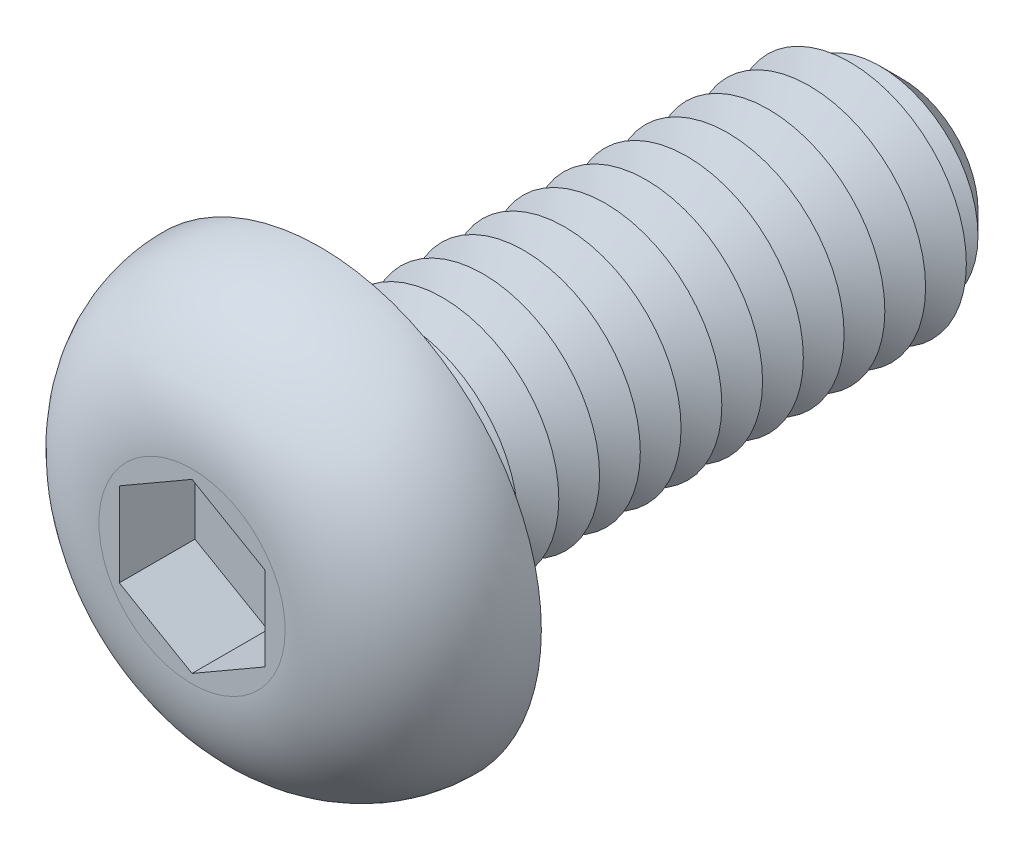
ISO-10303-21;
HEADER;
FILE_DESCRIPTION(('STEP AP214'),'2;1');
FILE_NAME('part.step','',(''),(''),'','','');
FILE_SCHEMA(('AUTOMOTIVE_DESIGN { 1 0 10303 214 1 1 1 1 }'));
ENDSEC;
DATA;
#1=APPLICATION_CONTEXT('core data for automotive mechanical design processes');
#2=APPLICATION_PROTOCOL_DEFINITION('international standard','automotive_design',2000,#1);
#3=PRODUCT_CONTEXT('',#1,'mechanical');
#4=PRODUCT('Part','Part','',(#3));
#5=PRODUCT_RELATED_PRODUCT_CATEGORY('part','',(#4));
#6=PRODUCT_DEFINITION_FORMATION('','',#4);
#7=PRODUCT_DEFINITION_CONTEXT('part definition',#1,'design');
#8=PRODUCT_DEFINITION('design','',#6,#7);
#9=PRODUCT_DEFINITION_SHAPE('','',#8);
#10=(LENGTH_UNIT() NAMED_UNIT(*) SI_UNIT(.MILLI.,.METRE.));
#11=(NAMED_UNIT(*) PLANE_ANGLE_UNIT() SI_UNIT($,.RADIAN.));
#12=(NAMED_UNIT(*) SI_UNIT($,.STERADIAN.) SOLID_ANGLE_UNIT());
#13=UNCERTAINTY_MEASURE_WITH_UNIT(LENGTH_MEASURE(1.E-05),#10,'distance_accuracy_value','');
#14=(GEOMETRIC_REPRESENTATION_CONTEXT(3) GLOBAL_UNCERTAINTY_ASSIGNED_CONTEXT((#13)) GLOBAL_UNIT_ASSIGNED_CONTEXT((#10,
#11,#12)) REPRESENTATION_CONTEXT('',''));
#15=CARTESIAN_POINT('',(0.,0.,0.));
#16=DIRECTION('',(0.,0.,1.));
#17=DIRECTION('',(1.,0.,0.));
#18=AXIS2_PLACEMENT_3D('',#15,#16,#17);
#19=CARTESIAN_POINT('',(0.,0.,-10.));
#20=DIRECTION('',(0.,0.,1.));
#21=DIRECTION('',(1.,0.,0.));
#22=AXIS2_PLACEMENT_3D('',#19,#20,#21);
#23=CYLINDRICAL_SURFACE('',#22,2.);
#24=CARTESIAN_POINT('',(0.,0.,-0.35));
#25=DIRECTION('',(0.,0.,1.));
#26=DIRECTION('',(1.,0.,0.));
#27=AXIS2_PLACEMENT_3D('',#24,#25,#26);
#28=CIRCLE('',#27,2.);
#29=CARTESIAN_POINT('',(2.,0.,-0.35));
#30=VERTEX_POINT('',#29);
#31=EDGE_CURVE('E48',#30,#30,#28,.F.);
#32=ORIENTED_EDGE('',*,*,#31,.T.);
#33=EDGE_LOOP('',(#32));
#34=FACE_BOUND('',#33,.T.);
#35=CARTESIAN_POINT('',(0.,0.,-0.699999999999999));
#36=DIRECTION('',(0.,0.,1.));
#37=DIRECTION('',(1.,0.,0.));
#38=AXIS2_PLACEMENT_3D('',#35,#36,#37);
#39=CIRCLE('',#38,2.);
#40=CARTESIAN_POINT('',(2.,0.,-0.699999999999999));
#41=VERTEX_POINT('',#40);
#42=EDGE_CURVE('E137',#41,#41,#39,.T.);
#43=ORIENTED_EDGE('',*,*,#42,.T.);
#44=EDGE_LOOP('',(#43));
#45=FACE_BOUND('',#44,.T.);
#46=ADVANCED_FACE('F39',(#34,#45),#23,.T.);
#47=CARTESIAN_POINT('',(0.,3.8,0.));
#48=DIRECTION('',(0.,0.,1.));
#49=DIRECTION('',(1.,0.,0.));
#50=AXIS2_PLACEMENT_3D('',#47,#48,#49);
#51=PLANE('',#50);
#52=CARTESIAN_POINT('',(0.,0.,0.));
#53=DIRECTION('',(0.,0.,1.));
#54=DIRECTION('',(1.,0.,0.));
#55=AXIS2_PLACEMENT_3D('',#52,#53,#54);
#56=CIRCLE('',#55,2.35);
#57=CARTESIAN_POINT('',(2.35,0.,0.));
#58=VERTEX_POINT('',#57);
#59=EDGE_CURVE('E11',#58,#58,#56,.T.);
#60=ORIENTED_EDGE('',*,*,#59,.T.);
#61=EDGE_LOOP('',(#60));
#62=FACE_BOUND('',#61,.T.);
#63=CARTESIAN_POINT('',(0.,0.,0.));
#64=DIRECTION('',(0.,0.,1.));
#65=DIRECTION('',(1.,0.,0.));
#66=AXIS2_PLACEMENT_3D('',#63,#64,#65);
#67=CIRCLE('',#66,3.8);
#68=CARTESIAN_POINT('',(3.8,0.,0.));
#69=VERTEX_POINT('',#68);
#70=EDGE_CURVE('E156',#69,#69,#67,.T.);
#71=ORIENTED_EDGE('',*,*,#70,.F.);
#72=EDGE_LOOP('',(#71));
#73=FACE_BOUND('',#72,.T.);
#74=ADVANCED_FACE('F202',(#62,#73),#51,.F.);
#75=CARTESIAN_POINT('',(0.,0.,2.2));
#76=DIRECTION('',(0.,0.,-1.));
#77=DIRECTION('',(-1.,0.,0.));
#78=AXIS2_PLACEMENT_3D('',#75,#76,#77);
#79=PLANE('',#78);
#80=DIRECTION('',(-0.866025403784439,-0.5,0.));
#81=VECTOR('',#80,1.);
#82=CARTESIAN_POINT('',(0.,1.44337567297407,2.2));
#83=LINE('',#82,#81);
#84=CARTESIAN_POINT('',(0.,1.44337567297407,2.2));
#85=VERTEX_POINT('',#84);
#86=CARTESIAN_POINT('',(-1.25,0.721687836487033,2.2));
#87=VERTEX_POINT('',#86);
#88=EDGE_CURVE('E136',#85,#87,#83,.T.);
#89=ORIENTED_EDGE('',*,*,#88,.F.);
#90=DIRECTION('',(-0.866025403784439,0.5,0.));
#91=VECTOR('',#90,1.);
#92=CARTESIAN_POINT('',(1.25,0.721687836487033,2.2));
#93=LINE('',#92,#91);
#94=CARTESIAN_POINT('',(1.25,0.721687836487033,2.2));
#95=VERTEX_POINT('',#94);
#96=EDGE_CURVE('E55',#95,#85,#93,.T.);
#97=ORIENTED_EDGE('',*,*,#96,.F.);
#98=DIRECTION('',(0.,1.,0.));
#99=VECTOR('',#98,1.);
#100=CARTESIAN_POINT('',(1.25,-0.721687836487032,2.2));
#101=LINE('',#100,#99);
#102=CARTESIAN_POINT('',(1.25,-0.721687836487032,2.2));
#103=VERTEX_POINT('',#102);
#104=EDGE_CURVE('E150',#103,#95,#101,.T.);
#105=ORIENTED_EDGE('',*,*,#104,.F.);
#106=DIRECTION('',(0.866025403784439,0.5,0.));
#107=VECTOR('',#106,1.);
#108=CARTESIAN_POINT('',(0.,-1.44337567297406,2.2));
#109=LINE('',#108,#107);
#110=CARTESIAN_POINT('',(0.,-1.44337567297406,2.2));
#111=VERTEX_POINT('',#110);
#112=EDGE_CURVE('E147',#111,#103,#109,.T.);
#113=ORIENTED_EDGE('',*,*,#112,.F.);
#114=DIRECTION('',(0.866025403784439,-0.5,0.));
#115=VECTOR('',#114,1.);
#116=CARTESIAN_POINT('',(-1.25,-0.721687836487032,2.2));
#117=LINE('',#116,#115);
#118=CARTESIAN_POINT('',(-1.25,-0.721687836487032,2.2));
#119=VERTEX_POINT('',#118);
#120=EDGE_CURVE('E103',#119,#111,#117,.T.);
#121=ORIENTED_EDGE('',*,*,#120,.F.);
#122=DIRECTION('',(0.,-1.,0.));
#123=VECTOR('',#122,1.);
#124=CARTESIAN_POINT('',(-1.25,0.721687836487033,2.2));
#125=LINE('',#124,#123);
#126=EDGE_CURVE('E141',#87,#119,#125,.T.);
#127=ORIENTED_EDGE('',*,*,#126,.F.);
#128=EDGE_LOOP('',(#89,#97,#105,#113,#121,#127));
#129=FACE_BOUND('',#128,.T.);
#130=CARTESIAN_POINT('',(0.,0.,2.2));
#131=DIRECTION('',(0.,0.,1.));
#132=DIRECTION('',(1.,0.,0.));
#133=AXIS2_PLACEMENT_3D('',#130,#131,#132);
#134=CIRCLE('',#133,1.6);
#135=CARTESIAN_POINT('',(1.6,0.,2.2));
#136=VERTEX_POINT('',#135);
#137=EDGE_CURVE('E169',#136,#136,#134,.T.);
#138=ORIENTED_EDGE('',*,*,#137,.T.);
#139=EDGE_LOOP('',(#138));
#140=FACE_BOUND('',#139,.T.);
#141=ADVANCED_FACE('F207',(#129,#140),#79,.F.);
#142=CARTESIAN_POINT('',(0.,0.,0.));
#143=DIRECTION('',(0.,0.,1.));
#144=DIRECTION('',(1.,0.,0.));
#145=AXIS2_PLACEMENT_3D('',#142,#143,#144);
#146=DEGENERATE_TOROIDAL_SURFACE('',#145,1.6,2.2,.T.);
#147=ORIENTED_EDGE('',*,*,#137,.F.);
#148=EDGE_LOOP('',(#147));
#149=FACE_BOUND('',#148,.T.);
#150=ORIENTED_EDGE('',*,*,#70,.T.);
#151=EDGE_LOOP('',(#150));
#152=FACE_BOUND('',#151,.T.);
#153=ADVANCED_FACE('F235',(#149,#152),#146,.T.);
#154=CARTESIAN_POINT('',(1.25,0.721687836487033,0.9));
#155=DIRECTION('',(0.5,0.866025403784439,0.));
#156=DIRECTION('',(-0.866025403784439,0.5,0.));
#157=AXIS2_PLACEMENT_3D('',#154,#155,#156);
#158=PLANE('',#157);
#159=ORIENTED_EDGE('',*,*,#96,.T.);
#160=DIRECTION('',(0.,0.,1.));
#161=VECTOR('',#160,1.);
#162=CARTESIAN_POINT('',(0.,1.44337567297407,0.9));
#163=LINE('',#162,#161);
#164=CARTESIAN_POINT('',(0.,1.44337567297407,0.9));
#165=VERTEX_POINT('',#164);
#166=EDGE_CURVE('E85',#165,#85,#163,.T.);
#167=ORIENTED_EDGE('',*,*,#166,.F.);
#168=DIRECTION('',(-0.866025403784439,0.5,0.));
#169=VECTOR('',#168,1.);
#170=CARTESIAN_POINT('',(1.25,0.721687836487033,0.9));
#171=LINE('',#170,#169);
#172=CARTESIAN_POINT('',(1.25,0.721687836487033,0.9));
#173=VERTEX_POINT('',#172);
#174=EDGE_CURVE('E153',#173,#165,#171,.T.);
#175=ORIENTED_EDGE('',*,*,#174,.F.);
#176=DIRECTION('',(0.,0.,1.));
#177=VECTOR('',#176,1.);
#178=CARTESIAN_POINT('',(1.25,0.721687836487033,0.9));
#179=LINE('',#178,#177);
#180=EDGE_CURVE('E63',#173,#95,#179,.T.);
#181=ORIENTED_EDGE('',*,*,#180,.T.);
#182=EDGE_LOOP('',(#159,#167,#175,#181));
#183=FACE_BOUND('',#182,.T.);
#184=ADVANCED_FACE('F221',(#183),#158,.F.);
#185=CARTESIAN_POINT('',(1.25,-0.721687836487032,0.9));
#186=DIRECTION('',(1.,0.,0.));
#187=DIRECTION('',(0.,1.,0.));
#188=AXIS2_PLACEMENT_3D('',#185,#186,#187);
#189=PLANE('',#188);
#190=ORIENTED_EDGE('',*,*,#104,.T.);
#191=ORIENTED_EDGE('',*,*,#180,.F.);
#192=DIRECTION('',(0.,1.,0.));
#193=VECTOR('',#192,1.);
#194=CARTESIAN_POINT('',(1.25,-0.721687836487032,0.9));
#195=LINE('',#194,#193);
#196=CARTESIAN_POINT('',(1.25,-0.721687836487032,0.9));
#197=VERTEX_POINT('',#196);
#198=EDGE_CURVE('E117',#197,#173,#195,.T.);
#199=ORIENTED_EDGE('',*,*,#198,.F.);
#200=DIRECTION('',(0.,0.,1.));
#201=VECTOR('',#200,1.);
#202=CARTESIAN_POINT('',(1.25,-0.721687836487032,0.9));
#203=LINE('',#202,#201);
#204=EDGE_CURVE('E108',#197,#103,#203,.T.);
#205=ORIENTED_EDGE('',*,*,#204,.T.);
#206=EDGE_LOOP('',(#190,#191,#199,#205));
#207=FACE_BOUND('',#206,.T.);
#208=ADVANCED_FACE('F218',(#207),#189,.F.);
#209=CARTESIAN_POINT('',(0.,-1.44337567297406,0.9));
#210=DIRECTION('',(0.5,-0.866025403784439,0.));
#211=DIRECTION('',(0.866025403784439,0.5,0.));
#212=AXIS2_PLACEMENT_3D('',#209,#210,#211);
#213=PLANE('',#212);
#214=ORIENTED_EDGE('',*,*,#112,.T.);
#215=ORIENTED_EDGE('',*,*,#204,.F.);
#216=DIRECTION('',(0.866025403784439,0.5,0.));
#217=VECTOR('',#216,1.);
#218=CARTESIAN_POINT('',(0.,-1.44337567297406,0.9));
#219=LINE('',#218,#217);
#220=CARTESIAN_POINT('',(0.,-1.44337567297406,0.9));
#221=VERTEX_POINT('',#220);
#222=EDGE_CURVE('E112',#221,#197,#219,.T.);
#223=ORIENTED_EDGE('',*,*,#222,.F.);
#224=DIRECTION('',(0.,0.,1.));
#225=VECTOR('',#224,1.);
#226=CARTESIAN_POINT('',(0.,-1.44337567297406,0.9));
#227=LINE('',#226,#225);
#228=EDGE_CURVE('E96',#221,#111,#227,.T.);
#229=ORIENTED_EDGE('',*,*,#228,.T.);
#230=EDGE_LOOP('',(#214,#215,#223,#229));
#231=FACE_BOUND('',#230,.T.);
#232=ADVANCED_FACE('F113',(#231),#213,.F.);
#233=CARTESIAN_POINT('',(-1.25,-0.721687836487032,0.9));
#234=DIRECTION('',(-0.5,-0.866025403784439,0.));
#235=DIRECTION('',(0.866025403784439,-0.5,0.));
#236=AXIS2_PLACEMENT_3D('',#233,#234,#235);
#237=PLANE('',#236);
#238=ORIENTED_EDGE('',*,*,#120,.T.);
#239=ORIENTED_EDGE('',*,*,#228,.F.);
#240=DIRECTION('',(0.866025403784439,-0.5,0.));
#241=VECTOR('',#240,1.);
#242=CARTESIAN_POINT('',(-1.25,-0.721687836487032,0.9));
#243=LINE('',#242,#241);
#244=CARTESIAN_POINT('',(-1.25,-0.721687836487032,0.9));
#245=VERTEX_POINT('',#244);
#246=EDGE_CURVE('E100',#245,#221,#243,.T.);
#247=ORIENTED_EDGE('',*,*,#246,.F.);
#248=DIRECTION('',(0.,0.,1.));
#249=VECTOR('',#248,1.);
#250=CARTESIAN_POINT('',(-1.25,-0.721687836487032,0.9));
#251=LINE('',#250,#249);
#252=EDGE_CURVE('E109',#245,#119,#251,.T.);
#253=ORIENTED_EDGE('',*,*,#252,.T.);
#254=EDGE_LOOP('',(#238,#239,#247,#253));
#255=FACE_BOUND('',#254,.T.);
#256=ADVANCED_FACE('F98',(#255),#237,.F.);
#257=CARTESIAN_POINT('',(-1.25,0.721687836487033,0.9));
#258=DIRECTION('',(-1.,0.,0.));
#259=DIRECTION('',(0.,-1.,0.));
#260=AXIS2_PLACEMENT_3D('',#257,#258,#259);
#261=PLANE('',#260);
#262=ORIENTED_EDGE('',*,*,#126,.T.);
#263=ORIENTED_EDGE('',*,*,#252,.F.);
#264=DIRECTION('',(0.,-1.,0.));
#265=VECTOR('',#264,1.);
#266=CARTESIAN_POINT('',(-1.25,0.721687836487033,0.9));
#267=LINE('',#266,#265);
#268=CARTESIAN_POINT('',(-1.25,0.721687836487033,0.9));
#269=VERTEX_POINT('',#268);
#270=EDGE_CURVE('E123',#269,#245,#267,.T.);
#271=ORIENTED_EDGE('',*,*,#270,.F.);
#272=DIRECTION('',(0.,0.,1.));
#273=VECTOR('',#272,1.);
#274=CARTESIAN_POINT('',(-1.25,0.721687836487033,0.9));
#275=LINE('',#274,#273);
#276=EDGE_CURVE('E161',#269,#87,#275,.T.);
#277=ORIENTED_EDGE('',*,*,#276,.T.);
#278=EDGE_LOOP('',(#262,#263,#271,#277));
#279=FACE_BOUND('',#278,.T.);
#280=ADVANCED_FACE('F226',(#279),#261,.F.);
#281=CARTESIAN_POINT('',(0.,1.44337567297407,0.9));
#282=DIRECTION('',(-0.5,0.866025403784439,0.));
#283=DIRECTION('',(-0.866025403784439,-0.5,0.));
#284=AXIS2_PLACEMENT_3D('',#281,#282,#283);
#285=PLANE('',#284);
#286=ORIENTED_EDGE('',*,*,#88,.T.);
#287=ORIENTED_EDGE('',*,*,#276,.F.);
#288=DIRECTION('',(-0.866025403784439,-0.5,0.));
#289=VECTOR('',#288,1.);
#290=CARTESIAN_POINT('',(0.,1.44337567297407,0.9));
#291=LINE('',#290,#289);
#292=EDGE_CURVE('E128',#165,#269,#291,.T.);
#293=ORIENTED_EDGE('',*,*,#292,.F.);
#294=ORIENTED_EDGE('',*,*,#166,.T.);
#295=EDGE_LOOP('',(#286,#287,#293,#294));
#296=FACE_BOUND('',#295,.T.);
#297=ADVANCED_FACE('F216',(#296),#285,.F.);
#298=CARTESIAN_POINT('',(0.,0.,0.9));
#299=DIRECTION('',(0.,0.,1.));
#300=DIRECTION('',(1.,0.,0.));
#301=AXIS2_PLACEMENT_3D('',#298,#299,#300);
#302=PLANE('',#301);
#303=CARTESIAN_POINT('',(0.,0.,0.9));
#304=DIRECTION('',(0.,0.,1.));
#305=DIRECTION('',(1.,0.,0.));
#306=AXIS2_PLACEMENT_3D('',#303,#304,#305);
#307=CIRCLE('',#306,0.5);
#308=CARTESIAN_POINT('',(0.5,0.,0.9));
#309=VERTEX_POINT('',#308);
#310=EDGE_CURVE('E359',#309,#309,#307,.T.);
#311=ORIENTED_EDGE('',*,*,#310,.F.);
#312=EDGE_LOOP('',(#311));
#313=FACE_BOUND('',#312,.T.);
#314=ORIENTED_EDGE('',*,*,#174,.T.);
#315=ORIENTED_EDGE('',*,*,#292,.T.);
#316=ORIENTED_EDGE('',*,*,#270,.T.);
#317=ORIENTED_EDGE('',*,*,#246,.T.);
#318=ORIENTED_EDGE('',*,*,#222,.T.);
#319=ORIENTED_EDGE('',*,*,#198,.T.);
#320=EDGE_LOOP('',(#314,#315,#316,#317,#318,#319));
#321=FACE_BOUND('',#320,.T.);
#322=ADVANCED_FACE('F120',(#313,#321),#302,.T.);
#323=CARTESIAN_POINT('',(0.,0.,-0.699999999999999));
#324=DIRECTION('',(0.,0.,1.));
#325=DIRECTION('',(1.,0.,0.));
#326=AXIS2_PLACEMENT_3D('',#323,#324,#325);
#327=CONICAL_SURFACE('',#326,2.,1.04719755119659);
#328=CARTESIAN_POINT('',(0.,0.,-1.05));
#329=DIRECTION('',(0.,0.,1.));
#330=DIRECTION('',(1.,0.,0.));
#331=AXIS2_PLACEMENT_3D('',#328,#329,#330);
#332=CIRCLE('',#331,1.39378221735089);
#333=CARTESIAN_POINT('',(1.39378221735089,0.,-1.05));
#334=VERTEX_POINT('',#333);
#335=EDGE_CURVE('E259',#334,#334,#332,.T.);
#336=ORIENTED_EDGE('',*,*,#335,.T.);
#337=EDGE_LOOP('',(#336));
#338=FACE_BOUND('',#337,.T.);
#339=ORIENTED_EDGE('',*,*,#42,.F.);
#340=EDGE_LOOP('',(#339));
#341=FACE_BOUND('',#340,.T.);
#342=ADVANCED_FACE('F215',(#338,#341),#327,.T.);
#343=CARTESIAN_POINT('',(0.,0.,-1.05));
#344=DIRECTION('',(0.,0.,-1.));
#345=DIRECTION('',(-1.,0.,0.));
#346=AXIS2_PLACEMENT_3D('',#343,#344,#345);
#347=CONICAL_SURFACE('',#346,1.39378221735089,1.0471975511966);
#348=CARTESIAN_POINT('',(0.,0.,-1.4));
#349=DIRECTION('',(0.,0.,1.));
#350=DIRECTION('',(1.,0.,0.));
#351=AXIS2_PLACEMENT_3D('',#348,#349,#350);
#352=CIRCLE('',#351,2.);
#353=CARTESIAN_POINT('',(2.,0.,-1.4));
#354=VERTEX_POINT('',#353);
#355=EDGE_CURVE('E263',#354,#354,#352,.T.);
#356=ORIENTED_EDGE('',*,*,#355,.T.);
#357=EDGE_LOOP('',(#356));
#358=FACE_BOUND('',#357,.T.);
#359=ORIENTED_EDGE('',*,*,#335,.F.);
#360=EDGE_LOOP('',(#359));
#361=FACE_BOUND('',#360,.T.);
#362=ADVANCED_FACE('F513',(#358,#361),#347,.T.);
#363=CARTESIAN_POINT('',(0.,0.,-1.4));
#364=DIRECTION('',(0.,0.,1.));
#365=DIRECTION('',(1.,0.,0.));
#366=AXIS2_PLACEMENT_3D('',#363,#364,#365);
#367=CONICAL_SURFACE('',#366,2.,1.04719755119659);
#368=CARTESIAN_POINT('',(0.,0.,-1.75));
#369=DIRECTION('',(0.,0.,1.));
#370=DIRECTION('',(1.,0.,0.));
#371=AXIS2_PLACEMENT_3D('',#368,#369,#370);
#372=CIRCLE('',#371,1.39378221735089);
#373=CARTESIAN_POINT('',(1.39378221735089,0.,-1.75));
#374=VERTEX_POINT('',#373);
#375=EDGE_CURVE('E266',#374,#374,#372,.T.);
#376=ORIENTED_EDGE('',*,*,#375,.T.);
#377=EDGE_LOOP('',(#376));
#378=FACE_BOUND('',#377,.T.);
#379=ORIENTED_EDGE('',*,*,#355,.F.);
#380=EDGE_LOOP('',(#379));
#381=FACE_BOUND('',#380,.T.);
#382=ADVANCED_FACE('F507',(#378,#381),#367,.T.);
#383=CARTESIAN_POINT('',(0.,0.,-1.75));
#384=DIRECTION('',(0.,0.,-1.));
#385=DIRECTION('',(-1.,0.,0.));
#386=AXIS2_PLACEMENT_3D('',#383,#384,#385);
#387=CONICAL_SURFACE('',#386,1.39378221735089,1.0471975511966);
#388=CARTESIAN_POINT('',(0.,0.,-2.1));
#389=DIRECTION('',(0.,0.,1.));
#390=DIRECTION('',(1.,0.,0.));
#391=AXIS2_PLACEMENT_3D('',#388,#389,#390);
#392=CIRCLE('',#391,2.);
#393=CARTESIAN_POINT('',(2.,0.,-2.1));
#394=VERTEX_POINT('',#393);
#395=EDGE_CURVE('E270',#394,#394,#392,.T.);
#396=ORIENTED_EDGE('',*,*,#395,.T.);
#397=EDGE_LOOP('',(#396));
#398=FACE_BOUND('',#397,.T.);
#399=ORIENTED_EDGE('',*,*,#375,.F.);
#400=EDGE_LOOP('',(#399));
#401=FACE_BOUND('',#400,.T.);
#402=ADVANCED_FACE('F501',(#398,#401),#387,.T.);
#403=CARTESIAN_POINT('',(0.,0.,-2.1));
#404=DIRECTION('',(0.,0.,1.));
#405=DIRECTION('',(1.,0.,0.));
#406=AXIS2_PLACEMENT_3D('',#403,#404,#405);
#407=CONICAL_SURFACE('',#406,2.,1.04719755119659);
#408=CARTESIAN_POINT('',(0.,0.,-2.45));
#409=DIRECTION('',(0.,0.,1.));
#410=DIRECTION('',(1.,0.,0.));
#411=AXIS2_PLACEMENT_3D('',#408,#409,#410);
#412=CIRCLE('',#411,1.39378221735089);
#413=CARTESIAN_POINT('',(1.39378221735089,0.,-2.45));
#414=VERTEX_POINT('',#413);
#415=EDGE_CURVE('E274',#414,#414,#412,.T.);
#416=ORIENTED_EDGE('',*,*,#415,.T.);
#417=EDGE_LOOP('',(#416));
#418=FACE_BOUND('',#417,.T.);
#419=ORIENTED_EDGE('',*,*,#395,.F.);
#420=EDGE_LOOP('',(#419));
#421=FACE_BOUND('',#420,.T.);
#422=ADVANCED_FACE('F495',(#418,#421),#407,.T.);
#423=CARTESIAN_POINT('',(0.,0.,-2.45));
#424=DIRECTION('',(0.,0.,-1.));
#425=DIRECTION('',(-1.,0.,0.));
#426=AXIS2_PLACEMENT_3D('',#423,#424,#425);
#427=CONICAL_SURFACE('',#426,1.39378221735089,1.0471975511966);
#428=CARTESIAN_POINT('',(0.,0.,-2.8));
#429=DIRECTION('',(0.,0.,1.));
#430=DIRECTION('',(1.,0.,0.));
#431=AXIS2_PLACEMENT_3D('',#428,#429,#430);
#432=CIRCLE('',#431,2.);
#433=CARTESIAN_POINT('',(2.,0.,-2.8));
#434=VERTEX_POINT('',#433);
#435=EDGE_CURVE('E278',#434,#434,#432,.T.);
#436=ORIENTED_EDGE('',*,*,#435,.T.);
#437=EDGE_LOOP('',(#436));
#438=FACE_BOUND('',#437,.T.);
#439=ORIENTED_EDGE('',*,*,#415,.F.);
#440=EDGE_LOOP('',(#439));
#441=FACE_BOUND('',#440,.T.);
#442=ADVANCED_FACE('F489',(#438,#441),#427,.T.);
#443=CARTESIAN_POINT('',(0.,0.,-2.8));
#444=DIRECTION('',(0.,0.,1.));
#445=DIRECTION('',(1.,0.,0.));
#446=AXIS2_PLACEMENT_3D('',#443,#444,#445);
#447=CONICAL_SURFACE('',#446,2.,1.04719755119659);
#448=CARTESIAN_POINT('',(0.,0.,-3.15));
#449=DIRECTION('',(0.,0.,1.));
#450=DIRECTION('',(1.,0.,0.));
#451=AXIS2_PLACEMENT_3D('',#448,#449,#450);
#452=CIRCLE('',#451,1.39378221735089);
#453=CARTESIAN_POINT('',(1.39378221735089,0.,-3.15));
#454=VERTEX_POINT('',#453);
#455=EDGE_CURVE('E282',#454,#454,#452,.T.);
#456=ORIENTED_EDGE('',*,*,#455,.T.);
#457=EDGE_LOOP('',(#456));
#458=FACE_BOUND('',#457,.T.);
#459=ORIENTED_EDGE('',*,*,#435,.F.);
#460=EDGE_LOOP('',(#459));
#461=FACE_BOUND('',#460,.T.);
#462=ADVANCED_FACE('F483',(#458,#461),#447,.T.);
#463=CARTESIAN_POINT('',(0.,0.,-3.15));
#464=DIRECTION('',(0.,0.,-1.));
#465=DIRECTION('',(-1.,0.,0.));
#466=AXIS2_PLACEMENT_3D('',#463,#464,#465);
#467=CONICAL_SURFACE('',#466,1.39378221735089,1.0471975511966);
#468=CARTESIAN_POINT('',(0.,0.,-3.5));
#469=DIRECTION('',(0.,0.,1.));
#470=DIRECTION('',(1.,0.,0.));
#471=AXIS2_PLACEMENT_3D('',#468,#469,#470);
#472=CIRCLE('',#471,2.);
#473=CARTESIAN_POINT('',(2.,0.,-3.5));
#474=VERTEX_POINT('',#473);
#475=EDGE_CURVE('E286',#474,#474,#472,.T.);
#476=ORIENTED_EDGE('',*,*,#475,.T.);
#477=EDGE_LOOP('',(#476));
#478=FACE_BOUND('',#477,.T.);
#479=ORIENTED_EDGE('',*,*,#455,.F.);
#480=EDGE_LOOP('',(#479));
#481=FACE_BOUND('',#480,.T.);
#482=ADVANCED_FACE('F477',(#478,#481),#467,.T.);
#483=CARTESIAN_POINT('',(0.,0.,-3.5));
#484=DIRECTION('',(0.,0.,1.));
#485=DIRECTION('',(1.,0.,0.));
#486=AXIS2_PLACEMENT_3D('',#483,#484,#485);
#487=CONICAL_SURFACE('',#486,2.,1.04719755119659);
#488=CARTESIAN_POINT('',(0.,0.,-3.85));
#489=DIRECTION('',(0.,0.,1.));
#490=DIRECTION('',(1.,0.,0.));
#491=AXIS2_PLACEMENT_3D('',#488,#489,#490);
#492=CIRCLE('',#491,1.39378221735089);
#493=CARTESIAN_POINT('',(1.39378221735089,0.,-3.85));
#494=VERTEX_POINT('',#493);
#495=EDGE_CURVE('E290',#494,#494,#492,.T.);
#496=ORIENTED_EDGE('',*,*,#495,.T.);
#497=EDGE_LOOP('',(#496));
#498=FACE_BOUND('',#497,.T.);
#499=ORIENTED_EDGE('',*,*,#475,.F.);
#500=EDGE_LOOP('',(#499));
#501=FACE_BOUND('',#500,.T.);
#502=ADVANCED_FACE('F471',(#498,#501),#487,.T.);
#503=CARTESIAN_POINT('',(0.,0.,-3.85));
#504=DIRECTION('',(0.,0.,-1.));
#505=DIRECTION('',(-1.,0.,0.));
#506=AXIS2_PLACEMENT_3D('',#503,#504,#505);
#507=CONICAL_SURFACE('',#506,1.39378221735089,1.0471975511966);
#508=CARTESIAN_POINT('',(0.,0.,-4.2));
#509=DIRECTION('',(0.,0.,1.));
#510=DIRECTION('',(1.,0.,0.));
#511=AXIS2_PLACEMENT_3D('',#508,#509,#510);
#512=CIRCLE('',#511,2.);
#513=CARTESIAN_POINT('',(2.,0.,-4.2));
#514=VERTEX_POINT('',#513);
#515=EDGE_CURVE('E294',#514,#514,#512,.T.);
#516=ORIENTED_EDGE('',*,*,#515,.T.);
#517=EDGE_LOOP('',(#516));
#518=FACE_BOUND('',#517,.T.);
#519=ORIENTED_EDGE('',*,*,#495,.F.);
#520=EDGE_LOOP('',(#519));
#521=FACE_BOUND('',#520,.T.);
#522=ADVANCED_FACE('F465',(#518,#521),#507,.T.);
#523=CARTESIAN_POINT('',(0.,0.,-4.2));
#524=DIRECTION('',(0.,0.,1.));
#525=DIRECTION('',(1.,0.,0.));
#526=AXIS2_PLACEMENT_3D('',#523,#524,#525);
#527=CONICAL_SURFACE('',#526,2.,1.04719755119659);
#528=CARTESIAN_POINT('',(0.,0.,-4.55));
#529=DIRECTION('',(0.,0.,1.));
#530=DIRECTION('',(1.,0.,0.));
#531=AXIS2_PLACEMENT_3D('',#528,#529,#530);
#532=CIRCLE('',#531,1.39378221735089);
#533=CARTESIAN_POINT('',(1.39378221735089,0.,-4.55));
#534=VERTEX_POINT('',#533);
#535=EDGE_CURVE('E298',#534,#534,#532,.T.);
#536=ORIENTED_EDGE('',*,*,#535,.T.);
#537=EDGE_LOOP('',(#536));
#538=FACE_BOUND('',#537,.T.);
#539=ORIENTED_EDGE('',*,*,#515,.F.);
#540=EDGE_LOOP('',(#539));
#541=FACE_BOUND('',#540,.T.);
#542=ADVANCED_FACE('F459',(#538,#541),#527,.T.);
#543=CARTESIAN_POINT('',(0.,0.,-4.55));
#544=DIRECTION('',(0.,0.,-1.));
#545=DIRECTION('',(-1.,0.,0.));
#546=AXIS2_PLACEMENT_3D('',#543,#544,#545);
#547=CONICAL_SURFACE('',#546,1.39378221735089,1.0471975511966);
#548=CARTESIAN_POINT('',(0.,0.,-4.9));
#549=DIRECTION('',(0.,0.,1.));
#550=DIRECTION('',(1.,0.,0.));
#551=AXIS2_PLACEMENT_3D('',#548,#549,#550);
#552=CIRCLE('',#551,2.);
#553=CARTESIAN_POINT('',(2.,0.,-4.9));
#554=VERTEX_POINT('',#553);
#555=EDGE_CURVE('E302',#554,#554,#552,.T.);
#556=ORIENTED_EDGE('',*,*,#555,.T.);
#557=EDGE_LOOP('',(#556));
#558=FACE_BOUND('',#557,.T.);
#559=ORIENTED_EDGE('',*,*,#535,.F.);
#560=EDGE_LOOP('',(#559));
#561=FACE_BOUND('',#560,.T.);
#562=ADVANCED_FACE('F453',(#558,#561),#547,.T.);
#563=CARTESIAN_POINT('',(0.,0.,-4.9));
#564=DIRECTION('',(0.,0.,1.));
#565=DIRECTION('',(1.,0.,0.));
#566=AXIS2_PLACEMENT_3D('',#563,#564,#565);
#567=CONICAL_SURFACE('',#566,2.,1.04719755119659);
#568=CARTESIAN_POINT('',(0.,0.,-5.25));
#569=DIRECTION('',(0.,0.,1.));
#570=DIRECTION('',(1.,0.,0.));
#571=AXIS2_PLACEMENT_3D('',#568,#569,#570);
#572=CIRCLE('',#571,1.39378221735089);
#573=CARTESIAN_POINT('',(1.39378221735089,0.,-5.25));
#574=VERTEX_POINT('',#573);
#575=EDGE_CURVE('E306',#574,#574,#572,.T.);
#576=ORIENTED_EDGE('',*,*,#575,.T.);
#577=EDGE_LOOP('',(#576));
#578=FACE_BOUND('',#577,.T.);
#579=ORIENTED_EDGE('',*,*,#555,.F.);
#580=EDGE_LOOP('',(#579));
#581=FACE_BOUND('',#580,.T.);
#582=ADVANCED_FACE('F447',(#578,#581),#567,.T.);
#583=CARTESIAN_POINT('',(0.,0.,-5.25));
#584=DIRECTION('',(0.,0.,-1.));
#585=DIRECTION('',(-1.,0.,0.));
#586=AXIS2_PLACEMENT_3D('',#583,#584,#585);
#587=CONICAL_SURFACE('',#586,1.39378221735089,1.0471975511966);
#588=CARTESIAN_POINT('',(0.,0.,-5.6));
#589=DIRECTION('',(0.,0.,1.));
#590=DIRECTION('',(1.,0.,0.));
#591=AXIS2_PLACEMENT_3D('',#588,#589,#590);
#592=CIRCLE('',#591,2.);
#593=CARTESIAN_POINT('',(2.,0.,-5.6));
#594=VERTEX_POINT('',#593);
#595=EDGE_CURVE('E310',#594,#594,#592,.T.);
#596=ORIENTED_EDGE('',*,*,#595,.T.);
#597=EDGE_LOOP('',(#596));
#598=FACE_BOUND('',#597,.T.);
#599=ORIENTED_EDGE('',*,*,#575,.F.);
#600=EDGE_LOOP('',(#599));
#601=FACE_BOUND('',#600,.T.);
#602=ADVANCED_FACE('F441',(#598,#601),#587,.T.);
#603=CARTESIAN_POINT('',(0.,0.,-5.6));
#604=DIRECTION('',(0.,0.,1.));
#605=DIRECTION('',(1.,0.,0.));
#606=AXIS2_PLACEMENT_3D('',#603,#604,#605);
#607=CONICAL_SURFACE('',#606,2.,1.04719755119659);
#608=CARTESIAN_POINT('',(0.,0.,-5.95));
#609=DIRECTION('',(0.,0.,1.));
#610=DIRECTION('',(1.,0.,0.));
#611=AXIS2_PLACEMENT_3D('',#608,#609,#610);
#612=CIRCLE('',#611,1.39378221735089);
#613=CARTESIAN_POINT('',(1.39378221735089,0.,-5.95));
#614=VERTEX_POINT('',#613);
#615=EDGE_CURVE('E314',#614,#614,#612,.T.);
#616=ORIENTED_EDGE('',*,*,#615,.T.);
#617=EDGE_LOOP('',(#616));
#618=FACE_BOUND('',#617,.T.);
#619=ORIENTED_EDGE('',*,*,#595,.F.);
#620=EDGE_LOOP('',(#619));
#621=FACE_BOUND('',#620,.T.);
#622=ADVANCED_FACE('F435',(#618,#621),#607,.T.);
#623=CARTESIAN_POINT('',(0.,0.,-5.95));
#624=DIRECTION('',(0.,0.,-1.));
#625=DIRECTION('',(-1.,0.,0.));
#626=AXIS2_PLACEMENT_3D('',#623,#624,#625);
#627=CONICAL_SURFACE('',#626,1.39378221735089,1.0471975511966);
#628=CARTESIAN_POINT('',(0.,0.,-6.3));
#629=DIRECTION('',(0.,0.,1.));
#630=DIRECTION('',(1.,0.,0.));
#631=AXIS2_PLACEMENT_3D('',#628,#629,#630);
#632=CIRCLE('',#631,2.);
#633=CARTESIAN_POINT('',(2.,0.,-6.3));
#634=VERTEX_POINT('',#633);
#635=EDGE_CURVE('E318',#634,#634,#632,.T.);
#636=ORIENTED_EDGE('',*,*,#635,.T.);
#637=EDGE_LOOP('',(#636));
#638=FACE_BOUND('',#637,.T.);
#639=ORIENTED_EDGE('',*,*,#615,.F.);
#640=EDGE_LOOP('',(#639));
#641=FACE_BOUND('',#640,.T.);
#642=ADVANCED_FACE('F429',(#638,#641),#627,.T.);
#643=CARTESIAN_POINT('',(0.,0.,-6.3));
#644=DIRECTION('',(0.,0.,1.));
#645=DIRECTION('',(1.,0.,0.));
#646=AXIS2_PLACEMENT_3D('',#643,#644,#645);
#647=CONICAL_SURFACE('',#646,2.,1.04719755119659);
#648=CARTESIAN_POINT('',(0.,0.,-6.65));
#649=DIRECTION('',(0.,0.,1.));
#650=DIRECTION('',(1.,0.,0.));
#651=AXIS2_PLACEMENT_3D('',#648,#649,#650);
#652=CIRCLE('',#651,1.39378221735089);
#653=CARTESIAN_POINT('',(1.39378221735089,0.,-6.65));
#654=VERTEX_POINT('',#653);
#655=EDGE_CURVE('E322',#654,#654,#652,.T.);
#656=ORIENTED_EDGE('',*,*,#655,.T.);
#657=EDGE_LOOP('',(#656));
#658=FACE_BOUND('',#657,.T.);
#659=ORIENTED_EDGE('',*,*,#635,.F.);
#660=EDGE_LOOP('',(#659));
#661=FACE_BOUND('',#660,.T.);
#662=ADVANCED_FACE('F423',(#658,#661),#647,.T.);
#663=CARTESIAN_POINT('',(0.,0.,-6.65));
#664=DIRECTION('',(0.,0.,-1.));
#665=DIRECTION('',(-1.,0.,0.));
#666=AXIS2_PLACEMENT_3D('',#663,#664,#665);
#667=CONICAL_SURFACE('',#666,1.39378221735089,1.0471975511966);
#668=CARTESIAN_POINT('',(0.,0.,-7.));
#669=DIRECTION('',(0.,0.,1.));
#670=DIRECTION('',(1.,0.,0.));
#671=AXIS2_PLACEMENT_3D('',#668,#669,#670);
#672=CIRCLE('',#671,2.);
#673=CARTESIAN_POINT('',(2.,0.,-7.));
#674=VERTEX_POINT('',#673);
#675=EDGE_CURVE('E326',#674,#674,#672,.T.);
#676=ORIENTED_EDGE('',*,*,#675,.T.);
#677=EDGE_LOOP('',(#676));
#678=FACE_BOUND('',#677,.T.);
#679=ORIENTED_EDGE('',*,*,#655,.F.);
#680=EDGE_LOOP('',(#679));
#681=FACE_BOUND('',#680,.T.);
#682=ADVANCED_FACE('F417',(#678,#681),#667,.T.);
#683=CARTESIAN_POINT('',(0.,0.,-7.));
#684=DIRECTION('',(0.,0.,1.));
#685=DIRECTION('',(1.,0.,0.));
#686=AXIS2_PLACEMENT_3D('',#683,#684,#685);
#687=CONICAL_SURFACE('',#686,2.,1.04719755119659);
#688=CARTESIAN_POINT('',(0.,0.,-7.35));
#689=DIRECTION('',(0.,0.,1.));
#690=DIRECTION('',(1.,0.,0.));
#691=AXIS2_PLACEMENT_3D('',#688,#689,#690);
#692=CIRCLE('',#691,1.39378221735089);
#693=CARTESIAN_POINT('',(1.39378221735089,0.,-7.35));
#694=VERTEX_POINT('',#693);
#695=EDGE_CURVE('E330',#694,#694,#692,.T.);
#696=ORIENTED_EDGE('',*,*,#695,.T.);
#697=EDGE_LOOP('',(#696));
#698=FACE_BOUND('',#697,.T.);
#699=ORIENTED_EDGE('',*,*,#675,.F.);
#700=EDGE_LOOP('',(#699));
#701=FACE_BOUND('',#700,.T.);
#702=ADVANCED_FACE('F411',(#698,#701),#687,.T.);
#703=CARTESIAN_POINT('',(0.,0.,-7.35));
#704=DIRECTION('',(0.,0.,-1.));
#705=DIRECTION('',(-1.,0.,0.));
#706=AXIS2_PLACEMENT_3D('',#703,#704,#705);
#707=CONICAL_SURFACE('',#706,1.39378221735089,1.0471975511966);
#708=CARTESIAN_POINT('',(0.,0.,-7.7));
#709=DIRECTION('',(0.,0.,1.));
#710=DIRECTION('',(1.,0.,0.));
#711=AXIS2_PLACEMENT_3D('',#708,#709,#710);
#712=CIRCLE('',#711,2.);
#713=CARTESIAN_POINT('',(2.,0.,-7.7));
#714=VERTEX_POINT('',#713);
#715=EDGE_CURVE('E334',#714,#714,#712,.T.);
#716=ORIENTED_EDGE('',*,*,#715,.T.);
#717=EDGE_LOOP('',(#716));
#718=FACE_BOUND('',#717,.T.);
#719=ORIENTED_EDGE('',*,*,#695,.F.);
#720=EDGE_LOOP('',(#719));
#721=FACE_BOUND('',#720,.T.);
#722=ADVANCED_FACE('F405',(#718,#721),#707,.T.);
#723=CARTESIAN_POINT('',(0.,0.,-7.7));
#724=DIRECTION('',(0.,0.,1.));
#725=DIRECTION('',(1.,0.,0.));
#726=AXIS2_PLACEMENT_3D('',#723,#724,#725);
#727=CONICAL_SURFACE('',#726,2.,1.04719755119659);
#728=CARTESIAN_POINT('',(0.,0.,-8.05));
#729=DIRECTION('',(0.,0.,1.));
#730=DIRECTION('',(1.,0.,0.));
#731=AXIS2_PLACEMENT_3D('',#728,#729,#730);
#732=CIRCLE('',#731,1.39378221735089);
#733=CARTESIAN_POINT('',(1.39378221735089,0.,-8.05));
#734=VERTEX_POINT('',#733);
#735=EDGE_CURVE('E338',#734,#734,#732,.T.);
#736=ORIENTED_EDGE('',*,*,#735,.T.);
#737=EDGE_LOOP('',(#736));
#738=FACE_BOUND('',#737,.T.);
#739=ORIENTED_EDGE('',*,*,#715,.F.);
#740=EDGE_LOOP('',(#739));
#741=FACE_BOUND('',#740,.T.);
#742=ADVANCED_FACE('F399',(#738,#741),#727,.T.);
#743=CARTESIAN_POINT('',(0.,0.,-8.05));
#744=DIRECTION('',(0.,0.,-1.));
#745=DIRECTION('',(-1.,0.,0.));
#746=AXIS2_PLACEMENT_3D('',#743,#744,#745);
#747=CONICAL_SURFACE('',#746,1.39378221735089,1.0471975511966);
#748=CARTESIAN_POINT('',(0.,0.,-8.4));
#749=DIRECTION('',(0.,0.,1.));
#750=DIRECTION('',(1.,0.,0.));
#751=AXIS2_PLACEMENT_3D('',#748,#749,#750);
#752=CIRCLE('',#751,2.);
#753=CARTESIAN_POINT('',(2.,0.,-8.4));
#754=VERTEX_POINT('',#753);
#755=EDGE_CURVE('E342',#754,#754,#752,.T.);
#756=ORIENTED_EDGE('',*,*,#755,.T.);
#757=EDGE_LOOP('',(#756));
#758=FACE_BOUND('',#757,.T.);
#759=ORIENTED_EDGE('',*,*,#735,.F.);
#760=EDGE_LOOP('',(#759));
#761=FACE_BOUND('',#760,.T.);
#762=ADVANCED_FACE('F393',(#758,#761),#747,.T.);
#763=CARTESIAN_POINT('',(0.,0.,-8.4));
#764=DIRECTION('',(0.,0.,1.));
#765=DIRECTION('',(1.,0.,0.));
#766=AXIS2_PLACEMENT_3D('',#763,#764,#765);
#767=CONICAL_SURFACE('',#766,2.,1.04719755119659);
#768=CARTESIAN_POINT('',(0.,0.,-8.75));
#769=DIRECTION('',(0.,0.,1.));
#770=DIRECTION('',(1.,0.,0.));
#771=AXIS2_PLACEMENT_3D('',#768,#769,#770);
#772=CIRCLE('',#771,1.39378221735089);
#773=CARTESIAN_POINT('',(1.39378221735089,0.,-8.75));
#774=VERTEX_POINT('',#773);
#775=EDGE_CURVE('E180',#774,#774,#772,.T.);
#776=ORIENTED_EDGE('',*,*,#775,.T.);
#777=EDGE_LOOP('',(#776));
#778=FACE_BOUND('',#777,.T.);
#779=ORIENTED_EDGE('',*,*,#755,.F.);
#780=EDGE_LOOP('',(#779));
#781=FACE_BOUND('',#780,.T.);
#782=ADVANCED_FACE('F387',(#778,#781),#767,.T.);
#783=CARTESIAN_POINT('',(0.,0.,-8.75));
#784=DIRECTION('',(0.,0.,-1.));
#785=DIRECTION('',(-1.,0.,0.));
#786=AXIS2_PLACEMENT_3D('',#783,#784,#785);
#787=CONICAL_SURFACE('',#786,1.39378221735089,1.0471975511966);
#788=CARTESIAN_POINT('',(0.,0.,-9.1));
#789=DIRECTION('',(0.,0.,1.));
#790=DIRECTION('',(1.,0.,0.));
#791=AXIS2_PLACEMENT_3D('',#788,#789,#790);
#792=CIRCLE('',#791,2.);
#793=CARTESIAN_POINT('',(2.,0.,-9.1));
#794=VERTEX_POINT('',#793);
#795=EDGE_CURVE('E181',#794,#794,#792,.T.);
#796=ORIENTED_EDGE('',*,*,#795,.T.);
#797=EDGE_LOOP('',(#796));
#798=FACE_BOUND('',#797,.T.);
#799=ORIENTED_EDGE('',*,*,#775,.F.);
#800=EDGE_LOOP('',(#799));
#801=FACE_BOUND('',#800,.T.);
#802=ADVANCED_FACE('F381',(#798,#801),#787,.T.);
#803=CARTESIAN_POINT('',(0.,0.,-9.1));
#804=DIRECTION('',(0.,0.,1.));
#805=DIRECTION('',(1.,0.,0.));
#806=AXIS2_PLACEMENT_3D('',#803,#804,#805);
#807=CONICAL_SURFACE('',#806,2.,1.04719755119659);
#808=CARTESIAN_POINT('',(0.,0.,-9.45));
#809=DIRECTION('',(0.,0.,1.));
#810=DIRECTION('',(1.,0.,0.));
#811=AXIS2_PLACEMENT_3D('',#808,#809,#810);
#812=CIRCLE('',#811,1.39378221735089);
#813=CARTESIAN_POINT('',(1.39378221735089,0.,-9.45));
#814=VERTEX_POINT('',#813);
#815=EDGE_CURVE('E351',#814,#814,#812,.T.);
#816=ORIENTED_EDGE('',*,*,#815,.T.);
#817=EDGE_LOOP('',(#816));
#818=FACE_BOUND('',#817,.T.);
#819=ORIENTED_EDGE('',*,*,#795,.F.);
#820=EDGE_LOOP('',(#819));
#821=FACE_BOUND('',#820,.T.);
#822=ADVANCED_FACE('F375',(#818,#821),#807,.T.);
#823=CARTESIAN_POINT('',(0.,0.,-9.45));
#824=DIRECTION('',(0.,0.,-1.));
#825=DIRECTION('',(-1.,0.,0.));
#826=AXIS2_PLACEMENT_3D('',#823,#824,#825);
#827=CONICAL_SURFACE('',#826,1.39378221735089,1.0471975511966);
#828=CARTESIAN_POINT('',(0.,0.,-9.61698729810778));
#829=DIRECTION('',(0.,0.,-1.));
#830=DIRECTION('',(-1.,0.,0.));
#831=AXIS2_PLACEMENT_3D('',#828,#829,#830);
#832=CIRCLE('',#831,1.68301270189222);
#833=CARTESIAN_POINT('',(1.68301270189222,0.,-9.61698729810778));
#834=VERTEX_POINT('',#833);
#835=EDGE_CURVE('E177',#834,#834,#832,.T.);
#836=ORIENTED_EDGE('',*,*,#835,.F.);
#837=EDGE_LOOP('',(#836));
#838=FACE_BOUND('',#837,.T.);
#839=ORIENTED_EDGE('',*,*,#815,.F.);
#840=EDGE_LOOP('',(#839));
#841=FACE_BOUND('',#840,.T.);
#842=ADVANCED_FACE('F368',(#838,#841),#827,.T.);
#843=CARTESIAN_POINT('',(0.,0.,-10.));
#844=DIRECTION('',(0.,0.,-1.));
#845=DIRECTION('',(-1.,0.,0.));
#846=AXIS2_PLACEMENT_3D('',#843,#844,#845);
#847=PLANE('',#846);
#848=CARTESIAN_POINT('',(0.,0.,-10.));
#849=DIRECTION('',(0.,0.,-1.));
#850=DIRECTION('',(-1.,0.,0.));
#851=AXIS2_PLACEMENT_3D('',#848,#849,#850);
#852=CIRCLE('',#851,0.5);
#853=CARTESIAN_POINT('',(-0.5,0.,-10.));
#854=VERTEX_POINT('',#853);
#855=EDGE_CURVE('E355',#854,#854,#852,.F.);
#856=ORIENTED_EDGE('',*,*,#855,.T.);
#857=EDGE_LOOP('',(#856));
#858=FACE_BOUND('',#857,.T.);
#859=CARTESIAN_POINT('',(0.,0.,-10.));
#860=DIRECTION('',(0.,0.,-1.));
#861=DIRECTION('',(-1.,0.,0.));
#862=AXIS2_PLACEMENT_3D('',#859,#860,#861);
#863=CIRCLE('',#862,1.3);
#864=CARTESIAN_POINT('',(1.30000000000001,0.,-10.));
#865=VERTEX_POINT('',#864);
#866=EDGE_CURVE('E173',#865,#865,#863,.T.);
#867=ORIENTED_EDGE('',*,*,#866,.T.);
#868=EDGE_LOOP('',(#867));
#869=FACE_BOUND('',#868,.T.);
#870=ADVANCED_FACE('F198',(#858,#869),#847,.T.);
#871=CARTESIAN_POINT('',(0.,0.,-10.));
#872=DIRECTION('',(0.,0.,1.));
#873=DIRECTION('',(1.,0.,0.));
#874=AXIS2_PLACEMENT_3D('',#871,#872,#873);
#875=CONICAL_SURFACE('',#874,1.3,0.785398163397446);
#876=CARTESIAN_POINT('',(1.30000000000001,0.,-10.));
#877=CARTESIAN_POINT('',(1.30398971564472,0.,-9.99601028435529));
#878=CARTESIAN_POINT('',(1.30797943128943,0.,-9.99202056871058));
#879=CARTESIAN_POINT('',(1.31595886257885,0.,-9.98404113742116));
#880=CARTESIAN_POINT('',(1.31994857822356,0.,-9.98005142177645));
#881=CARTESIAN_POINT('',(1.32792800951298,0.,-9.97207199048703));
#882=CARTESIAN_POINT('',(1.33191772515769,0.,-9.96808227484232));
#883=CARTESIAN_POINT('',(1.33989715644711,0.,-9.96010284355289));
#884=CARTESIAN_POINT('',(1.34388687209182,0.,-9.95611312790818));
#885=CARTESIAN_POINT('',(1.35186630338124,0.,-9.94813369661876));
#886=CARTESIAN_POINT('',(1.35585601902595,0.,-9.94414398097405));
#887=CARTESIAN_POINT('',(1.36383545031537,0.,-9.93616454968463));
#888=CARTESIAN_POINT('',(1.36782516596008,0.,-9.93217483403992));
#889=CARTESIAN_POINT('',(1.37580459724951,0.,-9.9241954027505));
#890=CARTESIAN_POINT('',(1.37979431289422,0.,-9.92020568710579));
#891=CARTESIAN_POINT('',(1.38777374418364,0.,-9.91222625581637));
#892=CARTESIAN_POINT('',(1.39176345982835,0.,-9.90823654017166));
#893=CARTESIAN_POINT('',(1.39974289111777,0.,-9.90025710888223));
#894=CARTESIAN_POINT('',(1.40373260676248,0.,-9.89626739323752));
#895=CARTESIAN_POINT('',(1.4117120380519,0.,-9.8882879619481));
#896=CARTESIAN_POINT('',(1.41570175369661,0.,-9.88429824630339));
#897=CARTESIAN_POINT('',(1.42368118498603,0.,-9.87631881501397));
#898=CARTESIAN_POINT('',(1.42767090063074,0.,-9.87232909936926));
#899=CARTESIAN_POINT('',(1.43565033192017,0.,-9.86434966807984));
#900=CARTESIAN_POINT('',(1.43964004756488,0.,-9.86035995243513));
#901=CARTESIAN_POINT('',(1.4476194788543,0.,-9.85238052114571));
#902=CARTESIAN_POINT('',(1.45160919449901,0.,-9.848390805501));
#903=CARTESIAN_POINT('',(1.45958862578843,0.,-9.84041137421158));
#904=CARTESIAN_POINT('',(1.46357834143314,0.,-9.83642165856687));
#905=CARTESIAN_POINT('',(1.47155777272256,0.,-9.82844222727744));
#906=CARTESIAN_POINT('',(1.47554748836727,0.,-9.82445251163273));
#907=CARTESIAN_POINT('',(1.48352691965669,0.,-9.81647308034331));
#908=CARTESIAN_POINT('',(1.4875166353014,0.,-9.8124833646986));
#909=CARTESIAN_POINT('',(1.49549606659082,0.,-9.80450393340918));
#910=CARTESIAN_POINT('',(1.49948578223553,0.,-9.80051421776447));
#911=CARTESIAN_POINT('',(1.50746521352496,0.,-9.79253478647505));
#912=CARTESIAN_POINT('',(1.51145492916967,0.,-9.78854507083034));
#913=CARTESIAN_POINT('',(1.51943436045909,0.,-9.78056563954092));
#914=CARTESIAN_POINT('',(1.5234240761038,0.,-9.77657592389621));
#915=CARTESIAN_POINT('',(1.53140350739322,0.,-9.76859649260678));
#916=CARTESIAN_POINT('',(1.53539322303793,0.,-9.76460677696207));
#917=CARTESIAN_POINT('',(1.54337265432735,0.,-9.75662734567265));
#918=CARTESIAN_POINT('',(1.54736236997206,0.,-9.75263763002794));
#919=CARTESIAN_POINT('',(1.55534180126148,0.,-9.74465819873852));
#920=CARTESIAN_POINT('',(1.55933151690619,0.,-9.74066848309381));
#921=CARTESIAN_POINT('',(1.56731094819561,0.,-9.73268905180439));
#922=CARTESIAN_POINT('',(1.57130066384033,0.,-9.72869933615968));
#923=CARTESIAN_POINT('',(1.57928009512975,0.,-9.72071990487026));
#924=CARTESIAN_POINT('',(1.58326981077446,0.,-9.71673018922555));
#925=CARTESIAN_POINT('',(1.59124924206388,0.,-9.70875075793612));
#926=CARTESIAN_POINT('',(1.59523895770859,0.,-9.70476104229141));
#927=CARTESIAN_POINT('',(1.60321838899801,0.,-9.69678161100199));
#928=CARTESIAN_POINT('',(1.60720810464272,0.,-9.69279189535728));
#929=CARTESIAN_POINT('',(1.61518753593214,0.,-9.68481246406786));
#930=CARTESIAN_POINT('',(1.61917725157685,0.,-9.68082274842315));
#931=CARTESIAN_POINT('',(1.62715668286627,0.,-9.67284331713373));
#932=CARTESIAN_POINT('',(1.63114639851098,0.,-9.66885360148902));
#933=CARTESIAN_POINT('',(1.63912582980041,0.,-9.6608741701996));
#934=CARTESIAN_POINT('',(1.64311554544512,0.,-9.65688445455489));
#935=CARTESIAN_POINT('',(1.65109497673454,0.,-9.64890502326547));
#936=CARTESIAN_POINT('',(1.65508469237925,0.,-9.64491530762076));
#937=CARTESIAN_POINT('',(1.66306412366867,0.,-9.63693587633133));
#938=CARTESIAN_POINT('',(1.66705383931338,0.,-9.63294616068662));
#939=CARTESIAN_POINT('',(1.6750332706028,0.,-9.6249667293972));
#940=CARTESIAN_POINT('',(1.67902298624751,0.,-9.62097701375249));
#941=CARTESIAN_POINT('',(1.68301270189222,0.,-9.61698729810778));
#942=B_SPLINE_CURVE_WITH_KNOTS('',3,(#876,#877,#878,#879,#880,#881,#882,#883,#884,#885,#886,
#887,#888,#889,#890,#891,#892,#893,#894,#895,#896,#897,#898,#899,#900,#901,#902,#903,#904,#905,
#906,#907,#908,#909,#910,#911,#912,#913,#914,#915,#916,#917,#918,#919,#920,#921,#922,#923,#924,
#925,#926,#927,#928,#929,#930,#931,#932,#933,#934,#935,#936,#937,#938,#939,#940,#941),
.UNSPECIFIED.,.F.,.F.,(4,2,2,2,2,2,2,2,2,2,2,2,2,2,2,2,2,2,2,2,2,2,2,2,2,2,2,2,2,2,2,2,4),(0.,
0.0169269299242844,0.0338538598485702,0.050780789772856,0.0677077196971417,0.0846346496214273,
0.101561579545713,0.118488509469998,0.135415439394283,0.152342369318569,0.169269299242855,
0.18619622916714,0.203123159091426,0.220050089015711,0.236977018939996,0.253903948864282,
0.270830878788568,0.287757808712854,0.304684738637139,0.321611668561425,0.33853859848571,
0.355465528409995,0.372392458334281,0.389319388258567,0.406246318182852,0.423173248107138,
0.440100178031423,0.457027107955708,0.473954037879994,0.49088096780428,0.507807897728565,
0.524734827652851,0.541661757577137),.UNSPECIFIED.);
#943=EDGE_CURVE('BSEAM190',#865,#834,#942,.T.);
#944=ORIENTED_EDGE('',*,*,#866,.F.);
#945=ORIENTED_EDGE('',*,*,#835,.T.);
#946=ORIENTED_EDGE('',*,*,#943,.T.);
#947=ORIENTED_EDGE('',*,*,#943,.F.);
#948=EDGE_LOOP('',(#944,#946,#945,#947));
#949=FACE_BOUND('',#948,.T.);
#950=ADVANCED_FACE('F190',(#949),#875,.T.);
#951=CARTESIAN_POINT('',(0.,0.,-0.35));
#952=DIRECTION('',(0.,0.,1.));
#953=DIRECTION('',(1.,0.,0.));
#954=AXIS2_PLACEMENT_3D('',#951,#952,#953);
#955=TOROIDAL_SURFACE('',#954,2.35,0.35);
#956=ORIENTED_EDGE('',*,*,#59,.F.);
#957=EDGE_LOOP('',(#956));
#958=FACE_BOUND('',#957,.T.);
#959=ORIENTED_EDGE('',*,*,#31,.F.);
#960=EDGE_LOOP('',(#959));
#961=FACE_BOUND('',#960,.T.);
#962=ADVANCED_FACE('F41',(#958,#961),#955,.F.);
#963=CARTESIAN_POINT('',(0.,0.,-11.4142135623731));
#964=DIRECTION('',(0.,0.,1.));
#965=DIRECTION('',(1.,0.,0.));
#966=AXIS2_PLACEMENT_3D('',#963,#964,#965);
#967=CYLINDRICAL_SURFACE('',#966,0.5);
#968=ORIENTED_EDGE('',*,*,#310,.T.);
#969=EDGE_LOOP('',(#968));
#970=FACE_BOUND('',#969,.T.);
#971=ORIENTED_EDGE('',*,*,#855,.F.);
#972=EDGE_LOOP('',(#971));
#973=FACE_BOUND('',#972,.T.);
#974=ADVANCED_FACE('F189',(#970,#973),#967,.F.);
#975=CLOSED_SHELL('',(#46,#74,#141,#153,#184,#208,#232,#256,#280,#297,#322,#342,#362,#382,#402,
#422,#442,#462,#482,#502,#522,#542,#562,#582,#602,#622,#642,#662,#682,#702,#722,#742,#762,#782,
#802,#822,#842,#870,#950,#962,#974));
#976=MANIFOLD_SOLID_BREP('B2',#975);
#977=ADVANCED_BREP_SHAPE_REPRESENTATION('',(#18,#976),#14);
#978=SHAPE_DEFINITION_REPRESENTATION(#9,#977);
ENDSEC;
END-ISO-10303-21;
